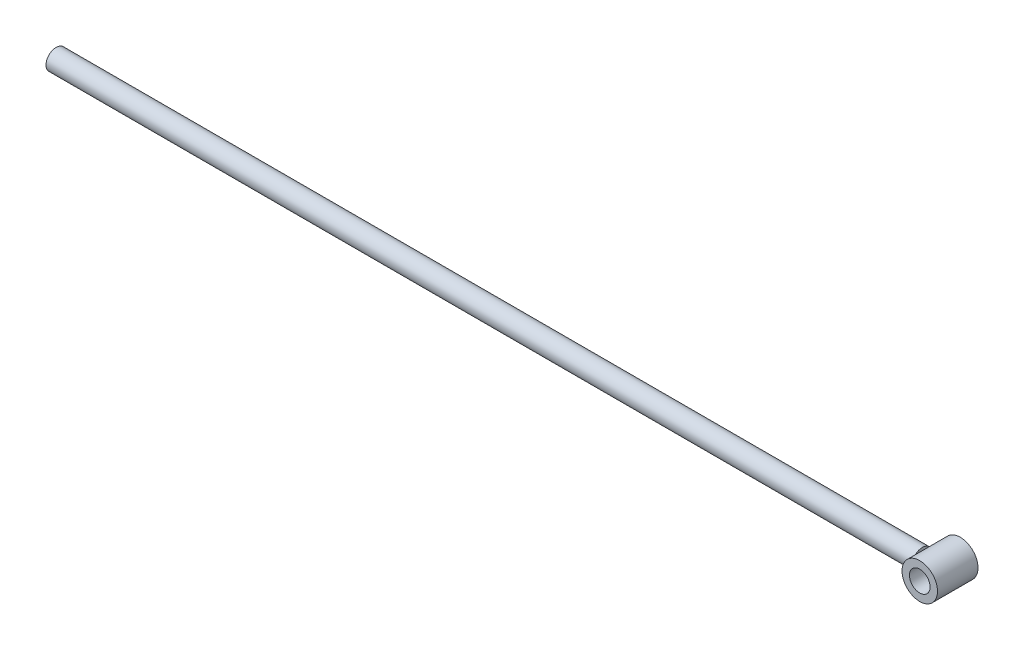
from build123d import *

# Parameters (mm, degrees)
ESQUISSE1_R      = 10
EXTRUSION1_DEPTH = 855
ESQUISSE2_R      = 17.5
ESQUISSE2_R_2    = 10.2
EXTRUSION2_DEPTH = 20


with BuildPart() as part:
    # Esquisse1 → Extrusion1 (new body)
    with BuildSketch(Plane(origin=(0, 0, 0), x_dir=(0, 0, -1), z_dir=(1, 0, 0))):
        with Locations(Location((0, 0, 0), (0, 0, 180))):
            Circle(ESQUISSE1_R)
    extrude(amount=EXTRUSION1_DEPTH)


with BuildPart() as body_2:
    # Esquisse2 → Extrusion2 (new, symmetric)
    with BuildSketch(Plane.XY):
        with Locations((872.5, 0)):
            Circle(ESQUISSE2_R)
        with Locations((872.5, 0)):
            Circle(ESQUISSE2_R_2, mode=Mode.SUBTRACT)
    extrude(amount=EXTRUSION2_DEPTH, both=True)


solid = Compound([part.part, body_2.part])
